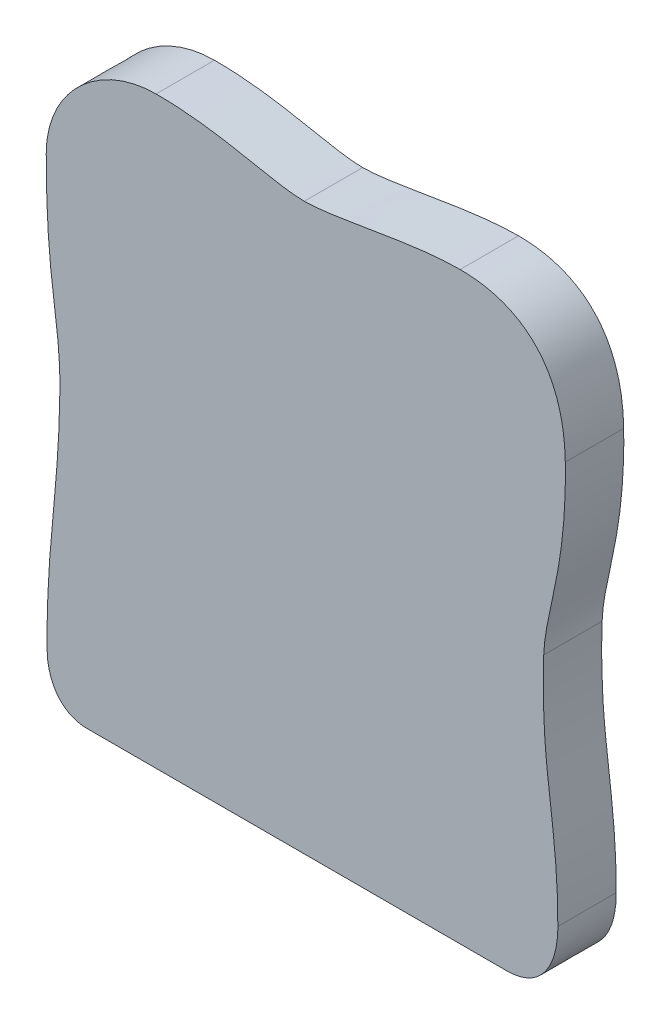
from build123d import *

# Parameters (mm, degrees)
BOSS_EXTRUDE1_DEPTH = 4.5


with BuildPart() as part:
    # Sketch1 → Boss-Extrude1 (new, symmetric)
    with BuildSketch(Plane.XY):
        with BuildLine():
            Line((30.8796, -45.0294), (-33.7517, -45.0294))
            add(Edge.make_bspline(
                [(-33.7517, -45.0294), (-37.7807, -45.0294), (-39.8581, -41.5785), (-39.8965, -37.6616)],
                knots=[0.090909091, 0.090909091, 0.090909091, 0.090909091, 0.181818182, 0.181818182, 0.181818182, 0.181818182], degree=3))
            add(Edge.make_bspline(
                [(-39.8965, -37.6616), (-40.0393, -23.0213), (-38.1191, -16.3179), (-37.939, -2.2074)],
                knots=[0.181818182, 0.181818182, 0.181818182, 0.181818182, 0.272727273, 0.272727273, 0.272727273, 0.272727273], degree=3))
            add(Edge.make_bspline(
                [(-37.939, -2.2074), (-37.8092, 7.9617), (-40.0393, 10.4926), (-40.0393, 28.5283)],
                knots=[0.272727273, 0.272727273, 0.272727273, 0.272727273, 0.363636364, 0.363636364, 0.363636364, 0.363636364], degree=3))
            add(Edge.make_bspline(
                [(-40.0393, 28.5283), (-40.0393, 37.5714), (-31.874, 44.9565), (-23.1146, 44.9706)],
                knots=[0.363636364, 0.363636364, 0.363636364, 0.363636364, 0.454545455, 0.454545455, 0.454545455, 0.454545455], degree=3))
            add(Edge.make_bspline(
                [(-23.1146, 44.9706), (-12.9085, 44.9868), (-5.2472, 42.0662), (-0.2786, 42.0662)],
                knots=[0.454545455, 0.454545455, 0.454545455, 0.454545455, 0.545454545, 0.545454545, 0.545454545, 0.545454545], degree=3))
            add(Edge.make_bspline(
                [(-0.2786, 42.0662), (4.6899, 42.0662), (15.9342, 44.9632), (23.7397, 44.9706)],
                knots=[0.545454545, 0.545454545, 0.545454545, 0.545454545, 0.636363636, 0.636363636, 0.636363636, 0.636363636], degree=3))
            add(Edge.make_bspline(
                [(23.7397, 44.9706), (33.1735, 44.9798), (39.7472, 39.5121), (39.9479, 27.3744)],
                knots=[0.636363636, 0.636363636, 0.636363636, 0.636363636, 0.727272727, 0.727272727, 0.727272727, 0.727272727], degree=3))
            add(Edge.make_bspline(
                [(39.9479, 27.3744), (40.1924, 12.6092), (36.8437, 6.4049), (36.6205, -0.0294)],
                knots=[0.727272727, 0.727272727, 0.727272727, 0.727272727, 0.818181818, 0.818181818, 0.818181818, 0.818181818], degree=3))
            add(Edge.make_bspline(
                [(36.6205, -0.0294), (36.0763, -15.728), (38.7977, -20.9047), (38.798, -35.1696)],
                knots=[0.818181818, 0.818181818, 0.818181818, 0.818181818, 0.909090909, 0.909090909, 0.909090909, 0.909090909], degree=3))
            add(Edge.make_bspline(
                [(38.798, -35.1696), (38.7984, -40.487), (36.349, -45.0294), (30.8796, -45.0294)],
                knots=[0.909090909, 0.909090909, 0.909090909, 0.909090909, 1, 1, 1, 1], degree=3))
        make_face()
    extrude(amount=BOSS_EXTRUDE1_DEPTH, both=True)


solid = part.part
